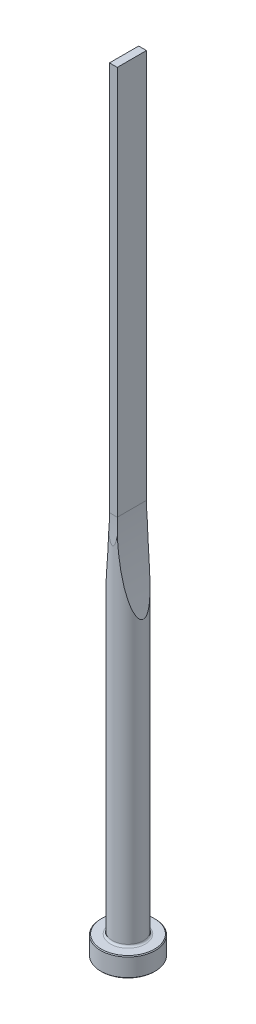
from build123d import *

# Parameters (mm, degrees)
CUT_EXTRUDE1_DEPTH = 5
CUT_EXTRUDE2_DEPTH = 5


with BuildPart() as part:
    # Sketch1 → Revolve1 (revolve)
    with BuildSketch(Plane.XY, mode=Mode.PRIVATE) as revolve1_sk:
        with BuildLine():
            Line((0, 0), (6.8, 0))
            Line((6.8, 0), (7, 0.2))
            Line((7, 0.2), (7, 4.8))
            Line((7, 4.8), (6.8, 5))
            Line((6.8, 5), (4.5, 5))
            ThreePointArc((4.5, 5), (4.146446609, 5.146446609), (4, 5.5))
            Line((4, 5.5), (4, 200))
            Line((4, 200), (0, 200))
            Line((0, 200), (0, 0))
        make_face()
    revolve(revolve1_sk.sketch.rotate(Axis((0, 200, 0), (0, -1, 0)), 180), axis=Axis((0, 200, 0), (0, -1, 0)))

    # Sketch2 → Cut-Extrude1 (cut, symmetric)
    with BuildSketch(Plane.XY):
        with BuildLine():
            Line((1, 200), (1, 100))
            ThreePointArc((1, 100), (1.753151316, 88.381049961), (4, 76.956562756))
            Line((4, 76.956562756), (4, 200))
            Line((4, 200), (1, 200))
        make_face()
        with BuildLine():
            Line((-1, 200), (-1, 100))
            ThreePointArc((-1, 100), (-1.753151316, 88.381049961), (-4, 76.956562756))
            Line((-4, 76.956562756), (-4, 200))
            Line((-4, 200), (-1, 200))
        make_face()
    extrude(amount=CUT_EXTRUDE1_DEPTH, both=True, mode=Mode.SUBTRACT)

    # Sketch3 → Cut-Extrude2 (cut, symmetric)
    with BuildSketch(Plane(origin=(0, 0, 0), x_dir=(0, 0, -1), z_dir=(1, 0, 0))):
        with BuildLine():
            Line((3.75, 200), (3.75, 100))
            ThreePointArc((3.75, 100), (3.812521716, 96.645898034), (4, 93.296456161))
            Line((4, 93.296456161), (4, 200))
            Line((4, 200), (3.75, 200))
        make_face()
        with BuildLine():
            Line((-3.75, 200), (-3.75, 100))
            ThreePointArc((-3.75, 100), (-3.812521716, 96.645898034), (-4, 93.296456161))
            Line((-4, 93.296456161), (-4, 200))
            Line((-4, 200), (-3.75, 200))
        make_face()
    extrude(amount=CUT_EXTRUDE2_DEPTH, both=True, mode=Mode.SUBTRACT)


solid = part.part
